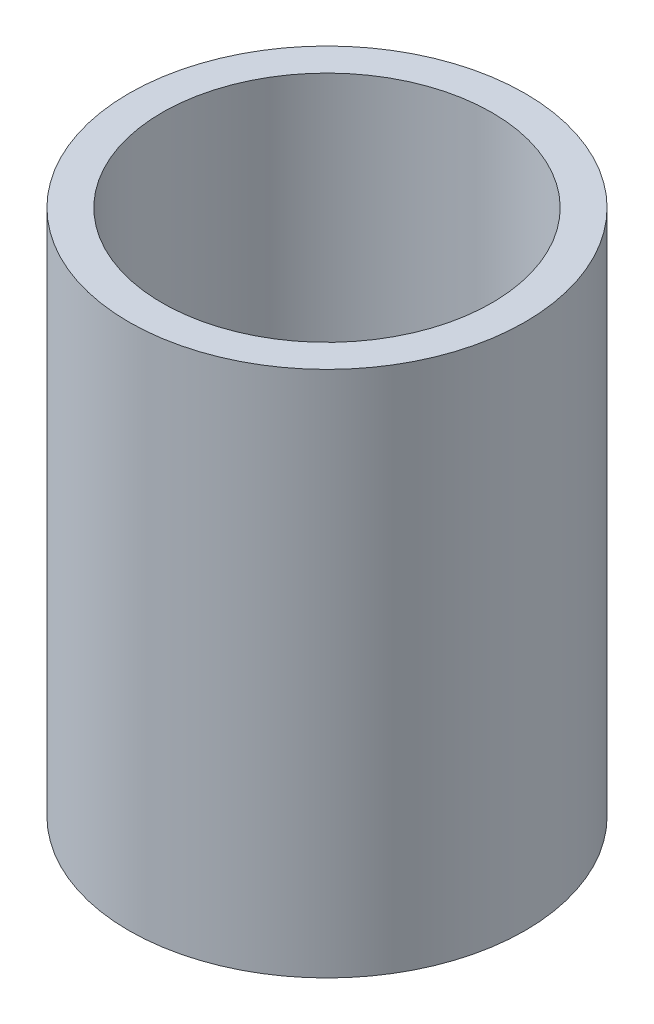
from build123d import *

# Parameters (mm, degrees)
SKETCH1_R           = 1.195
SKETCH1_R_2         = 0.995
BOSS_EXTRUDE1_DEPTH = 3.18


with BuildPart() as part:
    # Sketch1 → Boss-Extrude1 (new body)
    with BuildSketch(Plane(origin=(0, 0, 0), x_dir=(1, 0, 0), z_dir=(0, 1, 0))):
        with Locations(Location((0, 0, 0), (0, 0, 90))):
            Circle(SKETCH1_R)
        with Locations(Location((0, 0, 0), (0, 0, 90))):
            Circle(SKETCH1_R_2, mode=Mode.SUBTRACT)
    extrude(amount=BOSS_EXTRUDE1_DEPTH)


solid = part.part
